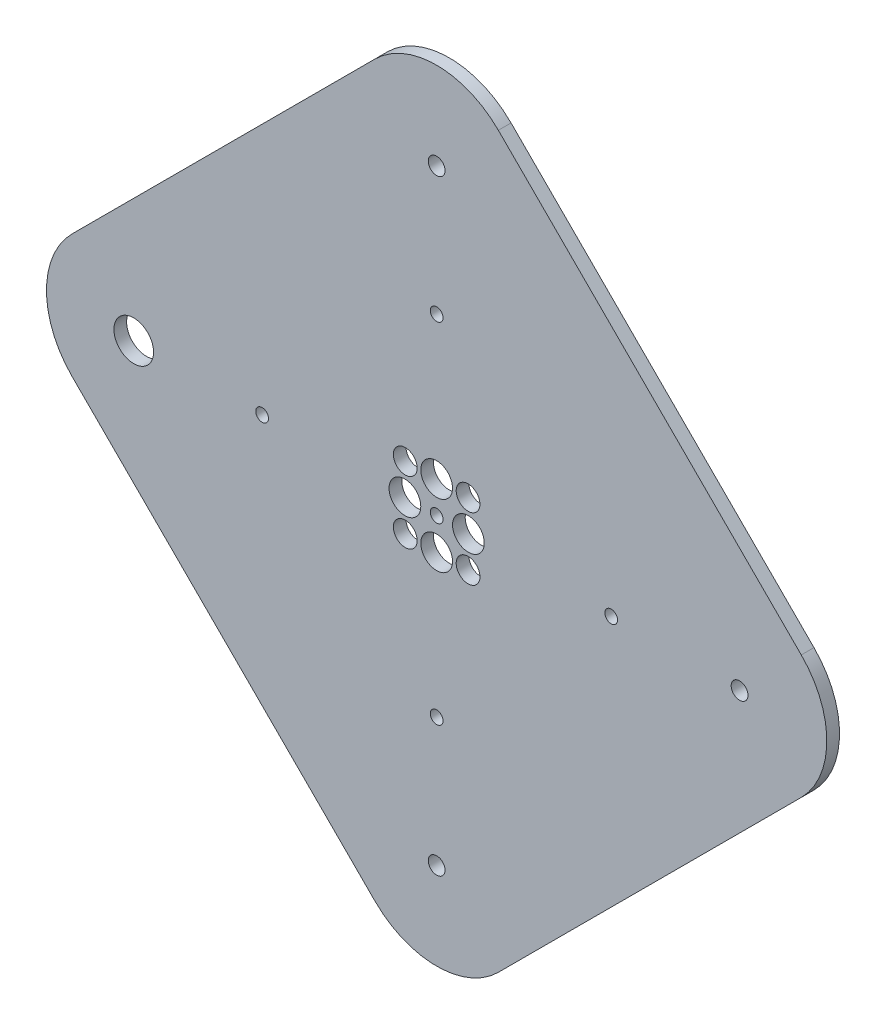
ISO-10303-21;
HEADER;
FILE_DESCRIPTION(('STEP AP214'),'2;1');
FILE_NAME('part.step','',(''),(''),'','','');
FILE_SCHEMA(('AUTOMOTIVE_DESIGN { 1 0 10303 214 1 1 1 1 }'));
ENDSEC;
DATA;
#1=APPLICATION_CONTEXT('core data for automotive mechanical design processes');
#2=APPLICATION_PROTOCOL_DEFINITION('international standard','automotive_design',2000,#1);
#3=PRODUCT_CONTEXT('',#1,'mechanical');
#4=PRODUCT('Part','Part','',(#3));
#5=PRODUCT_RELATED_PRODUCT_CATEGORY('part','',(#4));
#6=PRODUCT_DEFINITION_FORMATION('','',#4);
#7=PRODUCT_DEFINITION_CONTEXT('part definition',#1,'design');
#8=PRODUCT_DEFINITION('design','',#6,#7);
#9=PRODUCT_DEFINITION_SHAPE('','',#8);
#10=(LENGTH_UNIT() NAMED_UNIT(*) SI_UNIT(.MILLI.,.METRE.));
#11=(NAMED_UNIT(*) PLANE_ANGLE_UNIT() SI_UNIT($,.RADIAN.));
#12=(NAMED_UNIT(*) SI_UNIT($,.STERADIAN.) SOLID_ANGLE_UNIT());
#13=UNCERTAINTY_MEASURE_WITH_UNIT(LENGTH_MEASURE(1.E-05),#10,'distance_accuracy_value','');
#14=(GEOMETRIC_REPRESENTATION_CONTEXT(3) GLOBAL_UNCERTAINTY_ASSIGNED_CONTEXT((#13)) GLOBAL_UNIT_ASSIGNED_CONTEXT((#10,
#11,#12)) REPRESENTATION_CONTEXT('',''));
#15=CARTESIAN_POINT('',(0.,0.,0.));
#16=DIRECTION('',(0.,0.,1.));
#17=DIRECTION('',(1.,0.,0.));
#18=AXIS2_PLACEMENT_3D('',#15,#16,#17);
#19=CARTESIAN_POINT('',(-121.233457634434,-2.08166817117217E-13,5.08));
#20=DIRECTION('',(0.,0.,-1.));
#21=DIRECTION('',(-1.,0.,0.));
#22=AXIS2_PLACEMENT_3D('',#19,#20,#21);
#23=CYLINDRICAL_SURFACE('',#22,34.925);
#24=CARTESIAN_POINT('',(-121.233457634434,-2.08166817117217E-13,0.));
#25=DIRECTION('',(0.,0.,1.));
#26=DIRECTION('',(1.,0.,0.));
#27=AXIS2_PLACEMENT_3D('',#24,#25,#26);
#28=CIRCLE('',#27,34.925);
#29=CARTESIAN_POINT('',(-145.929161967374,24.6957043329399,0.));
#30=VERTEX_POINT('',#29);
#31=CARTESIAN_POINT('',(-145.929161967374,-24.6957043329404,0.));
#32=VERTEX_POINT('',#31);
#33=EDGE_CURVE('E136',#30,#32,#28,.T.);
#34=ORIENTED_EDGE('',*,*,#33,.T.);
#35=DIRECTION('',(0.,0.,-1.));
#36=VECTOR('',#35,1.);
#37=CARTESIAN_POINT('',(-145.929161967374,-24.6957043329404,5.08));
#38=LINE('',#37,#36);
#39=CARTESIAN_POINT('',(-145.929161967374,-24.6957043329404,5.08));
#40=VERTEX_POINT('',#39);
#41=EDGE_CURVE('E11',#40,#32,#38,.T.);
#42=ORIENTED_EDGE('',*,*,#41,.F.);
#43=CARTESIAN_POINT('',(-121.233457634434,-2.08166817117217E-13,5.08));
#44=DIRECTION('',(0.,0.,1.));
#45=DIRECTION('',(1.,0.,0.));
#46=AXIS2_PLACEMENT_3D('',#43,#44,#45);
#47=CIRCLE('',#46,34.925);
#48=CARTESIAN_POINT('',(-145.929161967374,24.6957043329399,5.08));
#49=VERTEX_POINT('',#48);
#50=EDGE_CURVE('E151',#49,#40,#47,.T.);
#51=ORIENTED_EDGE('',*,*,#50,.F.);
#52=DIRECTION('',(0.,0.,-1.));
#53=VECTOR('',#52,1.);
#54=CARTESIAN_POINT('',(-145.929161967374,24.6957043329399,5.08));
#55=LINE('',#54,#53);
#56=EDGE_CURVE('E132',#49,#30,#55,.T.);
#57=ORIENTED_EDGE('',*,*,#56,.T.);
#58=EDGE_LOOP('',(#34,#42,#51,#57));
#59=FACE_BOUND('',#58,.T.);
#60=ADVANCED_FACE('F40',(#59),#23,.T.);
#61=CARTESIAN_POINT('',(-145.929161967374,-24.6957043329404,5.08));
#62=DIRECTION('',(0.707106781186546,0.707106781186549,0.));
#63=DIRECTION('',(-0.707106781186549,0.707106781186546,0.));
#64=AXIS2_PLACEMENT_3D('',#61,#62,#63);
#65=PLANE('',#64);
#66=DIRECTION('',(0.707106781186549,-0.707106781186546,0.));
#67=VECTOR('',#66,1.);
#68=CARTESIAN_POINT('',(-145.929161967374,-24.6957043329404,0.));
#69=LINE('',#68,#67);
#70=CARTESIAN_POINT('',(-24.6957043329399,-145.929161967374,0.));
#71=VERTEX_POINT('',#70);
#72=EDGE_CURVE('E139',#32,#71,#69,.T.);
#73=ORIENTED_EDGE('',*,*,#72,.T.);
#74=DIRECTION('',(0.,0.,-1.));
#75=VECTOR('',#74,1.);
#76=CARTESIAN_POINT('',(-24.6957043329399,-145.929161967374,5.08));
#77=LINE('',#76,#75);
#78=CARTESIAN_POINT('',(-24.6957043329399,-145.929161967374,5.08));
#79=VERTEX_POINT('',#78);
#80=EDGE_CURVE('E48',#79,#71,#77,.T.);
#81=ORIENTED_EDGE('',*,*,#80,.F.);
#82=DIRECTION('',(0.707106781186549,-0.707106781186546,0.));
#83=VECTOR('',#82,1.);
#84=CARTESIAN_POINT('',(-145.929161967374,-24.6957043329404,5.08));
#85=LINE('',#84,#83);
#86=EDGE_CURVE('E99',#40,#79,#85,.T.);
#87=ORIENTED_EDGE('',*,*,#86,.F.);
#88=ORIENTED_EDGE('',*,*,#41,.T.);
#89=EDGE_LOOP('',(#73,#81,#87,#88));
#90=FACE_BOUND('',#89,.T.);
#91=ADVANCED_FACE('F340',(#90),#65,.F.);
#92=CARTESIAN_POINT('',(2.08166817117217E-13,-121.233457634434,5.08));
#93=DIRECTION('',(0.,0.,-1.));
#94=DIRECTION('',(-1.,0.,0.));
#95=AXIS2_PLACEMENT_3D('',#92,#93,#94);
#96=CYLINDRICAL_SURFACE('',#95,34.925);
#97=CARTESIAN_POINT('',(2.08166817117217E-13,-121.233457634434,0.));
#98=DIRECTION('',(0.,0.,1.));
#99=DIRECTION('',(1.,0.,0.));
#100=AXIS2_PLACEMENT_3D('',#97,#98,#99);
#101=CIRCLE('',#100,34.925);
#102=CARTESIAN_POINT('',(24.6957043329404,-145.929161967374,0.));
#103=VERTEX_POINT('',#102);
#104=EDGE_CURVE('E142',#71,#103,#101,.T.);
#105=ORIENTED_EDGE('',*,*,#104,.T.);
#106=DIRECTION('',(0.,0.,-1.));
#107=VECTOR('',#106,1.);
#108=CARTESIAN_POINT('',(24.6957043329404,-145.929161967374,5.08));
#109=LINE('',#108,#107);
#110=CARTESIAN_POINT('',(24.6957043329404,-145.929161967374,5.08));
#111=VERTEX_POINT('',#110);
#112=EDGE_CURVE('E158',#111,#103,#109,.T.);
#113=ORIENTED_EDGE('',*,*,#112,.F.);
#114=CARTESIAN_POINT('',(2.08166817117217E-13,-121.233457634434,5.08));
#115=DIRECTION('',(0.,0.,1.));
#116=DIRECTION('',(1.,0.,0.));
#117=AXIS2_PLACEMENT_3D('',#114,#115,#116);
#118=CIRCLE('',#117,34.925);
#119=EDGE_CURVE('E166',#79,#111,#118,.T.);
#120=ORIENTED_EDGE('',*,*,#119,.F.);
#121=ORIENTED_EDGE('',*,*,#80,.T.);
#122=EDGE_LOOP('',(#105,#113,#120,#121));
#123=FACE_BOUND('',#122,.T.);
#124=ADVANCED_FACE('F164',(#123),#96,.T.);
#125=CARTESIAN_POINT('',(24.6957043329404,-145.929161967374,5.08));
#126=DIRECTION('',(-0.707106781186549,0.707106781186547,0.));
#127=DIRECTION('',(-0.707106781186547,-0.707106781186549,0.));
#128=AXIS2_PLACEMENT_3D('',#125,#126,#127);
#129=PLANE('',#128);
#130=DIRECTION('',(0.707106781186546,0.707106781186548,0.));
#131=VECTOR('',#130,1.);
#132=CARTESIAN_POINT('',(24.6957043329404,-145.929161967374,0.));
#133=LINE('',#132,#131);
#134=CARTESIAN_POINT('',(145.929161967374,-24.6957043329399,0.));
#135=VERTEX_POINT('',#134);
#136=EDGE_CURVE('E144',#103,#135,#133,.T.);
#137=ORIENTED_EDGE('',*,*,#136,.T.);
#138=DIRECTION('',(0.,0.,-1.));
#139=VECTOR('',#138,1.);
#140=CARTESIAN_POINT('',(145.929161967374,-24.6957043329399,5.08));
#141=LINE('',#140,#139);
#142=CARTESIAN_POINT('',(145.929161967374,-24.6957043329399,5.08));
#143=VERTEX_POINT('',#142);
#144=EDGE_CURVE('E155',#143,#135,#141,.T.);
#145=ORIENTED_EDGE('',*,*,#144,.F.);
#146=DIRECTION('',(0.707106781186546,0.707106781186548,0.));
#147=VECTOR('',#146,1.);
#148=CARTESIAN_POINT('',(24.6957043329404,-145.929161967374,5.08));
#149=LINE('',#148,#147);
#150=EDGE_CURVE('E178',#111,#143,#149,.T.);
#151=ORIENTED_EDGE('',*,*,#150,.F.);
#152=ORIENTED_EDGE('',*,*,#112,.T.);
#153=EDGE_LOOP('',(#137,#145,#151,#152));
#154=FACE_BOUND('',#153,.T.);
#155=ADVANCED_FACE('F174',(#154),#129,.F.);
#156=CARTESIAN_POINT('',(121.233457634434,1.94289029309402E-13,5.08));
#157=DIRECTION('',(0.,0.,-1.));
#158=DIRECTION('',(-1.,0.,0.));
#159=AXIS2_PLACEMENT_3D('',#156,#157,#158);
#160=CYLINDRICAL_SURFACE('',#159,34.925);
#161=CARTESIAN_POINT('',(121.233457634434,1.94289029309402E-13,0.));
#162=DIRECTION('',(0.,0.,1.));
#163=DIRECTION('',(1.,0.,0.));
#164=AXIS2_PLACEMENT_3D('',#161,#162,#163);
#165=CIRCLE('',#164,34.925);
#166=CARTESIAN_POINT('',(145.929161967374,24.6957043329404,0.));
#167=VERTEX_POINT('',#166);
#168=EDGE_CURVE('E146',#135,#167,#165,.T.);
#169=ORIENTED_EDGE('',*,*,#168,.T.);
#170=DIRECTION('',(0.,0.,-1.));
#171=VECTOR('',#170,1.);
#172=CARTESIAN_POINT('',(145.929161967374,24.6957043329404,5.08));
#173=LINE('',#172,#171);
#174=CARTESIAN_POINT('',(145.929161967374,24.6957043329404,5.08));
#175=VERTEX_POINT('',#174);
#176=EDGE_CURVE('E127',#175,#167,#173,.T.);
#177=ORIENTED_EDGE('',*,*,#176,.F.);
#178=CARTESIAN_POINT('',(121.233457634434,1.94289029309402E-13,5.08));
#179=DIRECTION('',(0.,0.,1.));
#180=DIRECTION('',(1.,0.,0.));
#181=AXIS2_PLACEMENT_3D('',#178,#179,#180);
#182=CIRCLE('',#181,34.925);
#183=EDGE_CURVE('E118',#143,#175,#182,.T.);
#184=ORIENTED_EDGE('',*,*,#183,.F.);
#185=ORIENTED_EDGE('',*,*,#144,.T.);
#186=EDGE_LOOP('',(#169,#177,#184,#185));
#187=FACE_BOUND('',#186,.T.);
#188=ADVANCED_FACE('F177',(#187),#160,.T.);
#189=CARTESIAN_POINT('',(145.929161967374,24.6957043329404,5.08));
#190=DIRECTION('',(-0.707106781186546,-0.707106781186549,0.));
#191=DIRECTION('',(0.707106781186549,-0.707106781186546,0.));
#192=AXIS2_PLACEMENT_3D('',#189,#190,#191);
#193=PLANE('',#192);
#194=DIRECTION('',(-0.707106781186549,0.707106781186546,0.));
#195=VECTOR('',#194,1.);
#196=CARTESIAN_POINT('',(145.929161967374,24.6957043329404,0.));
#197=LINE('',#196,#195);
#198=CARTESIAN_POINT('',(24.6957043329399,145.929161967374,0.));
#199=VERTEX_POINT('',#198);
#200=EDGE_CURVE('E126',#167,#199,#197,.T.);
#201=ORIENTED_EDGE('',*,*,#200,.T.);
#202=DIRECTION('',(0.,0.,-1.));
#203=VECTOR('',#202,1.);
#204=CARTESIAN_POINT('',(24.6957043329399,145.929161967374,5.08));
#205=LINE('',#204,#203);
#206=CARTESIAN_POINT('',(24.6957043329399,145.929161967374,5.08));
#207=VERTEX_POINT('',#206);
#208=EDGE_CURVE('E123',#207,#199,#205,.T.);
#209=ORIENTED_EDGE('',*,*,#208,.F.);
#210=DIRECTION('',(-0.707106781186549,0.707106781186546,0.));
#211=VECTOR('',#210,1.);
#212=CARTESIAN_POINT('',(145.929161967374,24.6957043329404,5.08));
#213=LINE('',#212,#211);
#214=EDGE_CURVE('E112',#175,#207,#213,.T.);
#215=ORIENTED_EDGE('',*,*,#214,.F.);
#216=ORIENTED_EDGE('',*,*,#176,.T.);
#217=EDGE_LOOP('',(#201,#209,#215,#216));
#218=FACE_BOUND('',#217,.T.);
#219=ADVANCED_FACE('F124',(#218),#193,.F.);
#220=CARTESIAN_POINT('',(-2.42861286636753E-13,121.233457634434,5.08));
#221=DIRECTION('',(0.,0.,-1.));
#222=DIRECTION('',(-1.,0.,0.));
#223=AXIS2_PLACEMENT_3D('',#220,#221,#222);
#224=CYLINDRICAL_SURFACE('',#223,34.925);
#225=CARTESIAN_POINT('',(-2.42861286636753E-13,121.233457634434,0.));
#226=DIRECTION('',(0.,0.,1.));
#227=DIRECTION('',(1.,0.,0.));
#228=AXIS2_PLACEMENT_3D('',#225,#226,#227);
#229=CIRCLE('',#228,34.925);
#230=CARTESIAN_POINT('',(-24.6957043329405,145.929161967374,0.));
#231=VERTEX_POINT('',#230);
#232=EDGE_CURVE('E85',#199,#231,#229,.T.);
#233=ORIENTED_EDGE('',*,*,#232,.T.);
#234=DIRECTION('',(0.,0.,-1.));
#235=VECTOR('',#234,1.);
#236=CARTESIAN_POINT('',(-24.6957043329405,145.929161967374,5.08));
#237=LINE('',#236,#235);
#238=CARTESIAN_POINT('',(-24.6957043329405,145.929161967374,5.08));
#239=VERTEX_POINT('',#238);
#240=EDGE_CURVE('E128',#239,#231,#237,.T.);
#241=ORIENTED_EDGE('',*,*,#240,.F.);
#242=CARTESIAN_POINT('',(-2.42861286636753E-13,121.233457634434,5.08));
#243=DIRECTION('',(0.,0.,1.));
#244=DIRECTION('',(1.,0.,0.));
#245=AXIS2_PLACEMENT_3D('',#242,#243,#244);
#246=CIRCLE('',#245,34.925);
#247=EDGE_CURVE('E116',#207,#239,#246,.T.);
#248=ORIENTED_EDGE('',*,*,#247,.F.);
#249=ORIENTED_EDGE('',*,*,#208,.T.);
#250=EDGE_LOOP('',(#233,#241,#248,#249));
#251=FACE_BOUND('',#250,.T.);
#252=ADVANCED_FACE('F130',(#251),#224,.T.);
#253=CARTESIAN_POINT('',(-24.6957043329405,145.929161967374,5.08));
#254=DIRECTION('',(0.707106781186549,-0.707106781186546,0.));
#255=DIRECTION('',(0.707106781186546,0.707106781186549,0.));
#256=AXIS2_PLACEMENT_3D('',#253,#254,#255);
#257=PLANE('',#256);
#258=DIRECTION('',(-0.707106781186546,-0.707106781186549,0.));
#259=VECTOR('',#258,1.);
#260=CARTESIAN_POINT('',(-24.6957043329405,145.929161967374,0.));
#261=LINE('',#260,#259);
#262=EDGE_CURVE('E91',#231,#30,#261,.T.);
#263=ORIENTED_EDGE('',*,*,#262,.T.);
#264=ORIENTED_EDGE('',*,*,#56,.F.);
#265=DIRECTION('',(-0.707106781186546,-0.707106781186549,0.));
#266=VECTOR('',#265,1.);
#267=CARTESIAN_POINT('',(-24.6957043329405,145.929161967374,5.08));
#268=LINE('',#267,#266);
#269=EDGE_CURVE('E56',#239,#49,#268,.T.);
#270=ORIENTED_EDGE('',*,*,#269,.F.);
#271=ORIENTED_EDGE('',*,*,#240,.T.);
#272=EDGE_LOOP('',(#263,#264,#270,#271));
#273=FACE_BOUND('',#272,.T.);
#274=ADVANCED_FACE('F290',(#273),#257,.F.);
#275=CARTESIAN_POINT('',(-121.233457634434,-2.08166817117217E-13,5.08));
#276=DIRECTION('',(0.,0.,1.));
#277=DIRECTION('',(1.,0.,0.));
#278=AXIS2_PLACEMENT_3D('',#275,#276,#277);
#279=PLANE('',#278);
#280=CARTESIAN_POINT('',(0.,69.85,5.08));
#281=DIRECTION('',(0.,0.,1.));
#282=DIRECTION('',(1.,0.,0.));
#283=AXIS2_PLACEMENT_3D('',#280,#281,#282);
#284=CIRCLE('',#283,2.55269999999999);
#285=CARTESIAN_POINT('',(2.55269999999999,69.85,5.08));
#286=VERTEX_POINT('',#285);
#287=EDGE_CURVE('E282',#286,#286,#284,.T.);
#288=ORIENTED_EDGE('',*,*,#287,.F.);
#289=EDGE_LOOP('',(#288));
#290=FACE_BOUND('',#289,.T.);
#291=CARTESIAN_POINT('',(69.85,-2.43879971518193E-13,5.08));
#292=DIRECTION('',(0.,0.,1.));
#293=DIRECTION('',(1.,0.,0.));
#294=AXIS2_PLACEMENT_3D('',#291,#292,#293);
#295=CIRCLE('',#294,2.55269999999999);
#296=CARTESIAN_POINT('',(72.4027,-2.43879971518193E-13,5.08));
#297=VERTEX_POINT('',#296);
#298=EDGE_CURVE('E276',#297,#297,#295,.T.);
#299=ORIENTED_EDGE('',*,*,#298,.F.);
#300=EDGE_LOOP('',(#299));
#301=FACE_BOUND('',#300,.T.);
#302=CARTESIAN_POINT('',(-4.87759943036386E-13,-69.85,5.08));
#303=DIRECTION('',(0.,0.,1.));
#304=DIRECTION('',(1.,0.,0.));
#305=AXIS2_PLACEMENT_3D('',#302,#303,#304);
#306=CIRCLE('',#305,2.55269999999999);
#307=CARTESIAN_POINT('',(2.5526999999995,-69.85,5.08));
#308=VERTEX_POINT('',#307);
#309=EDGE_CURVE('E270',#308,#308,#306,.T.);
#310=ORIENTED_EDGE('',*,*,#309,.F.);
#311=EDGE_LOOP('',(#310));
#312=FACE_BOUND('',#311,.T.);
#313=CARTESIAN_POINT('',(-69.85,7.31639914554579E-13,5.08));
#314=DIRECTION('',(0.,0.,1.));
#315=DIRECTION('',(1.,0.,0.));
#316=AXIS2_PLACEMENT_3D('',#313,#314,#315);
#317=CIRCLE('',#316,2.55269999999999);
#318=CARTESIAN_POINT('',(-67.2973,7.31639914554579E-13,5.08));
#319=VERTEX_POINT('',#318);
#320=EDGE_CURVE('E264',#319,#319,#317,.T.);
#321=ORIENTED_EDGE('',*,*,#320,.F.);
#322=EDGE_LOOP('',(#321));
#323=FACE_BOUND('',#322,.T.);
#324=CARTESIAN_POINT('',(-2.42861286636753E-13,121.233457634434,5.08));
#325=DIRECTION('',(0.,0.,1.));
#326=DIRECTION('',(1.,0.,0.));
#327=AXIS2_PLACEMENT_3D('',#324,#325,#326);
#328=CIRCLE('',#327,3.3655);
#329=CARTESIAN_POINT('',(3.36549999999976,121.233457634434,5.08));
#330=VERTEX_POINT('',#329);
#331=EDGE_CURVE('E257',#330,#330,#328,.T.);
#332=ORIENTED_EDGE('',*,*,#331,.F.);
#333=EDGE_LOOP('',(#332));
#334=FACE_BOUND('',#333,.T.);
#335=CARTESIAN_POINT('',(121.233457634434,1.94289029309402E-13,5.08));
#336=DIRECTION('',(0.,0.,1.));
#337=DIRECTION('',(1.,0.,0.));
#338=AXIS2_PLACEMENT_3D('',#335,#336,#337);
#339=CIRCLE('',#338,3.3655);
#340=CARTESIAN_POINT('',(124.598957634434,1.94289029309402E-13,5.08));
#341=VERTEX_POINT('',#340);
#342=EDGE_CURVE('E251',#341,#341,#339,.T.);
#343=ORIENTED_EDGE('',*,*,#342,.F.);
#344=EDGE_LOOP('',(#343));
#345=FACE_BOUND('',#344,.T.);
#346=CARTESIAN_POINT('',(2.0122792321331E-13,-121.233457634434,5.08));
#347=DIRECTION('',(0.,0.,1.));
#348=DIRECTION('',(1.,0.,0.));
#349=AXIS2_PLACEMENT_3D('',#346,#347,#348);
#350=CIRCLE('',#349,3.3655);
#351=CARTESIAN_POINT('',(3.3655000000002,-121.233457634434,5.08));
#352=VERTEX_POINT('',#351);
#353=EDGE_CURVE('E244',#352,#352,#350,.T.);
#354=ORIENTED_EDGE('',*,*,#353,.F.);
#355=EDGE_LOOP('',(#354));
#356=FACE_BOUND('',#355,.T.);
#357=CARTESIAN_POINT('',(-121.233457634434,-1.94289029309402E-13,5.08));
#358=DIRECTION('',(0.,0.,1.));
#359=DIRECTION('',(1.,0.,0.));
#360=AXIS2_PLACEMENT_3D('',#357,#358,#359);
#361=CIRCLE('',#360,7.93749999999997);
#362=CARTESIAN_POINT('',(-113.295957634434,-1.94289029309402E-13,5.08));
#363=VERTEX_POINT('',#362);
#364=EDGE_CURVE('E238',#363,#363,#361,.T.);
#365=ORIENTED_EDGE('',*,*,#364,.F.);
#366=EDGE_LOOP('',(#365));
#367=FACE_BOUND('',#366,.T.);
#368=CARTESIAN_POINT('',(12.5723585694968,12.5723585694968,5.08));
#369=DIRECTION('',(0.,0.,1.));
#370=DIRECTION('',(1.,0.,0.));
#371=AXIS2_PLACEMENT_3D('',#368,#369,#370);
#372=CIRCLE('',#371,4.76250000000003);
#373=CARTESIAN_POINT('',(17.3348585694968,12.5723585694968,5.08));
#374=VERTEX_POINT('',#373);
#375=EDGE_CURVE('E233',#374,#374,#372,.T.);
#376=ORIENTED_EDGE('',*,*,#375,.F.);
#377=EDGE_LOOP('',(#376));
#378=FACE_BOUND('',#377,.T.);
#379=CARTESIAN_POINT('',(12.5723585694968,-12.5723585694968,5.08));
#380=DIRECTION('',(0.,0.,1.));
#381=DIRECTION('',(1.,0.,0.));
#382=AXIS2_PLACEMENT_3D('',#379,#380,#381);
#383=CIRCLE('',#382,4.7625);
#384=CARTESIAN_POINT('',(17.3348585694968,-12.5723585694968,5.08));
#385=VERTEX_POINT('',#384);
#386=EDGE_CURVE('E227',#385,#385,#383,.T.);
#387=ORIENTED_EDGE('',*,*,#386,.F.);
#388=EDGE_LOOP('',(#387));
#389=FACE_BOUND('',#388,.T.);
#390=CARTESIAN_POINT('',(-12.5723585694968,-12.5723585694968,5.08));
#391=DIRECTION('',(0.,0.,1.));
#392=DIRECTION('',(1.,0.,0.));
#393=AXIS2_PLACEMENT_3D('',#390,#391,#392);
#394=CIRCLE('',#393,4.7625);
#395=CARTESIAN_POINT('',(-7.80985856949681,-12.5723585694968,5.08));
#396=VERTEX_POINT('',#395);
#397=EDGE_CURVE('E220',#396,#396,#394,.T.);
#398=ORIENTED_EDGE('',*,*,#397,.F.);
#399=EDGE_LOOP('',(#398));
#400=FACE_BOUND('',#399,.T.);
#401=CARTESIAN_POINT('',(-12.5723585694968,12.5723585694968,5.08));
#402=DIRECTION('',(0.,0.,1.));
#403=DIRECTION('',(1.,0.,0.));
#404=AXIS2_PLACEMENT_3D('',#401,#402,#403);
#405=CIRCLE('',#404,4.7625);
#406=CARTESIAN_POINT('',(-7.80985856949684,12.5723585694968,5.08));
#407=VERTEX_POINT('',#406);
#408=EDGE_CURVE('E214',#407,#407,#405,.T.);
#409=ORIENTED_EDGE('',*,*,#408,.F.);
#410=EDGE_LOOP('',(#409));
#411=FACE_BOUND('',#410,.T.);
#412=CARTESIAN_POINT('',(0.,0.,5.08));
#413=DIRECTION('',(0.,0.,1.));
#414=DIRECTION('',(1.,0.,0.));
#415=AXIS2_PLACEMENT_3D('',#412,#413,#414);
#416=CIRCLE('',#415,2.5527);
#417=CARTESIAN_POINT('',(2.5527,0.,5.08));
#418=VERTEX_POINT('',#417);
#419=EDGE_CURVE('E210',#418,#418,#416,.T.);
#420=ORIENTED_EDGE('',*,*,#419,.F.);
#421=EDGE_LOOP('',(#420));
#422=FACE_BOUND('',#421,.T.);
#423=CARTESIAN_POINT('',(0.,-12.7,5.08));
#424=DIRECTION('',(0.,0.,1.));
#425=DIRECTION('',(1.,0.,0.));
#426=AXIS2_PLACEMENT_3D('',#423,#424,#425);
#427=CIRCLE('',#426,6.35000000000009);
#428=CARTESIAN_POINT('',(6.35000000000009,-12.7,5.08));
#429=VERTEX_POINT('',#428);
#430=EDGE_CURVE('E196',#429,#429,#427,.T.);
#431=ORIENTED_EDGE('',*,*,#430,.F.);
#432=EDGE_LOOP('',(#431));
#433=FACE_BOUND('',#432,.T.);
#434=CARTESIAN_POINT('',(-12.7,0.,5.08));
#435=DIRECTION('',(0.,0.,1.));
#436=DIRECTION('',(1.,0.,0.));
#437=AXIS2_PLACEMENT_3D('',#434,#435,#436);
#438=CIRCLE('',#437,6.35000000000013);
#439=CARTESIAN_POINT('',(-6.34999999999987,0.,5.08));
#440=VERTEX_POINT('',#439);
#441=EDGE_CURVE('E202',#440,#440,#438,.T.);
#442=ORIENTED_EDGE('',*,*,#441,.F.);
#443=EDGE_LOOP('',(#442));
#444=FACE_BOUND('',#443,.T.);
#445=CARTESIAN_POINT('',(12.7,0.,5.08));
#446=DIRECTION('',(0.,0.,1.));
#447=DIRECTION('',(1.,0.,0.));
#448=AXIS2_PLACEMENT_3D('',#445,#446,#447);
#449=CIRCLE('',#448,6.35000000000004);
#450=CARTESIAN_POINT('',(19.05,0.,5.08));
#451=VERTEX_POINT('',#450);
#452=EDGE_CURVE('E190',#451,#451,#449,.T.);
#453=ORIENTED_EDGE('',*,*,#452,.F.);
#454=EDGE_LOOP('',(#453));
#455=FACE_BOUND('',#454,.T.);
#456=CARTESIAN_POINT('',(0.,12.7,5.08));
#457=DIRECTION('',(0.,0.,1.));
#458=DIRECTION('',(1.,0.,0.));
#459=AXIS2_PLACEMENT_3D('',#456,#457,#458);
#460=CIRCLE('',#459,6.35);
#461=CARTESIAN_POINT('',(6.35,12.7,5.08));
#462=VERTEX_POINT('',#461);
#463=EDGE_CURVE('E184',#462,#462,#460,.T.);
#464=ORIENTED_EDGE('',*,*,#463,.F.);
#465=EDGE_LOOP('',(#464));
#466=FACE_BOUND('',#465,.T.);
#467=ORIENTED_EDGE('',*,*,#50,.T.);
#468=ORIENTED_EDGE('',*,*,#86,.T.);
#469=ORIENTED_EDGE('',*,*,#119,.T.);
#470=ORIENTED_EDGE('',*,*,#150,.T.);
#471=ORIENTED_EDGE('',*,*,#183,.T.);
#472=ORIENTED_EDGE('',*,*,#214,.T.);
#473=ORIENTED_EDGE('',*,*,#247,.T.);
#474=ORIENTED_EDGE('',*,*,#269,.T.);
#475=EDGE_LOOP('',(#467,#468,#469,#470,#471,#472,#473,#474));
#476=FACE_BOUND('',#475,.T.);
#477=ADVANCED_FACE('F114',(#290,#301,#312,#323,#334,#345,#356,#367,#378,#389,#400,#411,#422,
#433,#444,#455,#466,#476),#279,.T.);
#478=CARTESIAN_POINT('',(-121.233457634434,-2.08166817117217E-13,0.));
#479=DIRECTION('',(0.,0.,1.));
#480=DIRECTION('',(1.,0.,0.));
#481=AXIS2_PLACEMENT_3D('',#478,#479,#480);
#482=PLANE('',#481);
#483=CARTESIAN_POINT('',(0.,69.85,0.));
#484=DIRECTION('',(0.,0.,1.));
#485=DIRECTION('',(1.,0.,0.));
#486=AXIS2_PLACEMENT_3D('',#483,#484,#485);
#487=CIRCLE('',#486,2.5527);
#488=CARTESIAN_POINT('',(2.5527,69.85,0.));
#489=VERTEX_POINT('',#488);
#490=EDGE_CURVE('E279',#489,#489,#487,.T.);
#491=ORIENTED_EDGE('',*,*,#490,.T.);
#492=EDGE_LOOP('',(#491));
#493=FACE_BOUND('',#492,.T.);
#494=CARTESIAN_POINT('',(69.85,-2.43879971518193E-13,0.));
#495=DIRECTION('',(0.,0.,1.));
#496=DIRECTION('',(1.,0.,0.));
#497=AXIS2_PLACEMENT_3D('',#494,#495,#496);
#498=CIRCLE('',#497,2.55270000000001);
#499=CARTESIAN_POINT('',(72.4027,-2.43879971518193E-13,0.));
#500=VERTEX_POINT('',#499);
#501=EDGE_CURVE('E273',#500,#500,#498,.T.);
#502=ORIENTED_EDGE('',*,*,#501,.T.);
#503=EDGE_LOOP('',(#502));
#504=FACE_BOUND('',#503,.T.);
#505=CARTESIAN_POINT('',(-4.87759943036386E-13,-69.85,0.));
#506=DIRECTION('',(0.,0.,1.));
#507=DIRECTION('',(1.,0.,0.));
#508=AXIS2_PLACEMENT_3D('',#505,#506,#507);
#509=CIRCLE('',#508,2.5527);
#510=CARTESIAN_POINT('',(2.55269999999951,-69.85,0.));
#511=VERTEX_POINT('',#510);
#512=EDGE_CURVE('E267',#511,#511,#509,.T.);
#513=ORIENTED_EDGE('',*,*,#512,.T.);
#514=EDGE_LOOP('',(#513));
#515=FACE_BOUND('',#514,.T.);
#516=CARTESIAN_POINT('',(-69.85,7.31639914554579E-13,0.));
#517=DIRECTION('',(0.,0.,1.));
#518=DIRECTION('',(1.,0.,0.));
#519=AXIS2_PLACEMENT_3D('',#516,#517,#518);
#520=CIRCLE('',#519,2.55270000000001);
#521=CARTESIAN_POINT('',(-67.2973,7.31639914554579E-13,0.));
#522=VERTEX_POINT('',#521);
#523=EDGE_CURVE('E248',#522,#522,#520,.T.);
#524=ORIENTED_EDGE('',*,*,#523,.T.);
#525=EDGE_LOOP('',(#524));
#526=FACE_BOUND('',#525,.T.);
#527=CARTESIAN_POINT('',(-2.42861286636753E-13,121.233457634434,0.));
#528=DIRECTION('',(0.,0.,1.));
#529=DIRECTION('',(1.,0.,0.));
#530=AXIS2_PLACEMENT_3D('',#527,#528,#529);
#531=CIRCLE('',#530,3.3655);
#532=CARTESIAN_POINT('',(3.36549999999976,121.233457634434,0.));
#533=VERTEX_POINT('',#532);
#534=EDGE_CURVE('E241',#533,#533,#531,.T.);
#535=ORIENTED_EDGE('',*,*,#534,.T.);
#536=EDGE_LOOP('',(#535));
#537=FACE_BOUND('',#536,.T.);
#538=CARTESIAN_POINT('',(121.233457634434,1.94289029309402E-13,0.));
#539=DIRECTION('',(0.,0.,1.));
#540=DIRECTION('',(1.,0.,0.));
#541=AXIS2_PLACEMENT_3D('',#538,#539,#540);
#542=CIRCLE('',#541,3.3655);
#543=CARTESIAN_POINT('',(124.598957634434,1.94289029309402E-13,0.));
#544=VERTEX_POINT('',#543);
#545=EDGE_CURVE('E254',#544,#544,#542,.T.);
#546=ORIENTED_EDGE('',*,*,#545,.T.);
#547=EDGE_LOOP('',(#546));
#548=FACE_BOUND('',#547,.T.);
#549=CARTESIAN_POINT('',(2.0122792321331E-13,-121.233457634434,0.));
#550=DIRECTION('',(0.,0.,1.));
#551=DIRECTION('',(1.,0.,0.));
#552=AXIS2_PLACEMENT_3D('',#549,#550,#551);
#553=CIRCLE('',#552,3.3655);
#554=CARTESIAN_POINT('',(3.3655000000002,-121.233457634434,0.));
#555=VERTEX_POINT('',#554);
#556=EDGE_CURVE('E247',#555,#555,#553,.T.);
#557=ORIENTED_EDGE('',*,*,#556,.T.);
#558=EDGE_LOOP('',(#557));
#559=FACE_BOUND('',#558,.T.);
#560=CARTESIAN_POINT('',(-121.233457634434,-1.94289029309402E-13,0.));
#561=DIRECTION('',(0.,0.,1.));
#562=DIRECTION('',(1.,0.,0.));
#563=AXIS2_PLACEMENT_3D('',#560,#561,#562);
#564=CIRCLE('',#563,7.93749999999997);
#565=CARTESIAN_POINT('',(-113.295957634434,-1.94289029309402E-13,0.));
#566=VERTEX_POINT('',#565);
#567=EDGE_CURVE('E224',#566,#566,#564,.T.);
#568=ORIENTED_EDGE('',*,*,#567,.T.);
#569=EDGE_LOOP('',(#568));
#570=FACE_BOUND('',#569,.T.);
#571=CARTESIAN_POINT('',(12.5723585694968,12.5723585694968,0.));
#572=DIRECTION('',(0.,0.,1.));
#573=DIRECTION('',(1.,0.,0.));
#574=AXIS2_PLACEMENT_3D('',#571,#572,#573);
#575=CIRCLE('',#574,4.76250000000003);
#576=CARTESIAN_POINT('',(17.3348585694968,12.5723585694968,0.));
#577=VERTEX_POINT('',#576);
#578=EDGE_CURVE('E217',#577,#577,#575,.T.);
#579=ORIENTED_EDGE('',*,*,#578,.T.);
#580=EDGE_LOOP('',(#579));
#581=FACE_BOUND('',#580,.T.);
#582=CARTESIAN_POINT('',(12.5723585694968,-12.5723585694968,0.));
#583=DIRECTION('',(0.,0.,1.));
#584=DIRECTION('',(1.,0.,0.));
#585=AXIS2_PLACEMENT_3D('',#582,#583,#584);
#586=CIRCLE('',#585,4.7625);
#587=CARTESIAN_POINT('',(17.3348585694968,-12.5723585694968,0.));
#588=VERTEX_POINT('',#587);
#589=EDGE_CURVE('E230',#588,#588,#586,.T.);
#590=ORIENTED_EDGE('',*,*,#589,.T.);
#591=EDGE_LOOP('',(#590));
#592=FACE_BOUND('',#591,.T.);
#593=CARTESIAN_POINT('',(-12.5723585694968,-12.5723585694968,0.));
#594=DIRECTION('',(0.,0.,1.));
#595=DIRECTION('',(1.,0.,0.));
#596=AXIS2_PLACEMENT_3D('',#593,#594,#595);
#597=CIRCLE('',#596,4.7625);
#598=CARTESIAN_POINT('',(-7.80985856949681,-12.5723585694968,0.));
#599=VERTEX_POINT('',#598);
#600=EDGE_CURVE('E223',#599,#599,#597,.T.);
#601=ORIENTED_EDGE('',*,*,#600,.T.);
#602=EDGE_LOOP('',(#601));
#603=FACE_BOUND('',#602,.T.);
#604=CARTESIAN_POINT('',(-12.5723585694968,12.5723585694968,0.));
#605=DIRECTION('',(0.,0.,1.));
#606=DIRECTION('',(1.,0.,0.));
#607=AXIS2_PLACEMENT_3D('',#604,#605,#606);
#608=CIRCLE('',#607,4.7625);
#609=CARTESIAN_POINT('',(-7.80985856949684,12.5723585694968,0.));
#610=VERTEX_POINT('',#609);
#611=EDGE_CURVE('E213',#610,#610,#608,.T.);
#612=ORIENTED_EDGE('',*,*,#611,.T.);
#613=EDGE_LOOP('',(#612));
#614=FACE_BOUND('',#613,.T.);
#615=CARTESIAN_POINT('',(0.,0.,0.));
#616=DIRECTION('',(0.,0.,1.));
#617=DIRECTION('',(1.,0.,0.));
#618=AXIS2_PLACEMENT_3D('',#615,#616,#617);
#619=CIRCLE('',#618,2.5527);
#620=CARTESIAN_POINT('',(2.5527,0.,0.));
#621=VERTEX_POINT('',#620);
#622=EDGE_CURVE('E205',#621,#621,#619,.T.);
#623=ORIENTED_EDGE('',*,*,#622,.T.);
#624=EDGE_LOOP('',(#623));
#625=FACE_BOUND('',#624,.T.);
#626=CARTESIAN_POINT('',(0.,-12.7,0.));
#627=DIRECTION('',(0.,0.,1.));
#628=DIRECTION('',(1.,0.,0.));
#629=AXIS2_PLACEMENT_3D('',#626,#627,#628);
#630=CIRCLE('',#629,6.35000000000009);
#631=CARTESIAN_POINT('',(6.35000000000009,-12.7,0.));
#632=VERTEX_POINT('',#631);
#633=EDGE_CURVE('E193',#632,#632,#630,.T.);
#634=ORIENTED_EDGE('',*,*,#633,.T.);
#635=EDGE_LOOP('',(#634));
#636=FACE_BOUND('',#635,.T.);
#637=CARTESIAN_POINT('',(-12.7,0.,0.));
#638=DIRECTION('',(0.,0.,1.));
#639=DIRECTION('',(1.,0.,0.));
#640=AXIS2_PLACEMENT_3D('',#637,#638,#639);
#641=CIRCLE('',#640,6.35000000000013);
#642=CARTESIAN_POINT('',(-6.34999999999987,0.,0.));
#643=VERTEX_POINT('',#642);
#644=EDGE_CURVE('E199',#643,#643,#641,.T.);
#645=ORIENTED_EDGE('',*,*,#644,.T.);
#646=EDGE_LOOP('',(#645));
#647=FACE_BOUND('',#646,.T.);
#648=CARTESIAN_POINT('',(12.7,0.,0.));
#649=DIRECTION('',(0.,0.,1.));
#650=DIRECTION('',(1.,0.,0.));
#651=AXIS2_PLACEMENT_3D('',#648,#649,#650);
#652=CIRCLE('',#651,6.35000000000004);
#653=CARTESIAN_POINT('',(19.05,0.,0.));
#654=VERTEX_POINT('',#653);
#655=EDGE_CURVE('E187',#654,#654,#652,.T.);
#656=ORIENTED_EDGE('',*,*,#655,.T.);
#657=EDGE_LOOP('',(#656));
#658=FACE_BOUND('',#657,.T.);
#659=CARTESIAN_POINT('',(0.,12.7,0.));
#660=DIRECTION('',(0.,0.,1.));
#661=DIRECTION('',(1.,0.,0.));
#662=AXIS2_PLACEMENT_3D('',#659,#660,#661);
#663=CIRCLE('',#662,6.35);
#664=CARTESIAN_POINT('',(6.35,12.7,0.));
#665=VERTEX_POINT('',#664);
#666=EDGE_CURVE('E140',#665,#665,#663,.T.);
#667=ORIENTED_EDGE('',*,*,#666,.T.);
#668=EDGE_LOOP('',(#667));
#669=FACE_BOUND('',#668,.T.);
#670=ORIENTED_EDGE('',*,*,#33,.F.);
#671=ORIENTED_EDGE('',*,*,#262,.F.);
#672=ORIENTED_EDGE('',*,*,#232,.F.);
#673=ORIENTED_EDGE('',*,*,#200,.F.);
#674=ORIENTED_EDGE('',*,*,#168,.F.);
#675=ORIENTED_EDGE('',*,*,#136,.F.);
#676=ORIENTED_EDGE('',*,*,#104,.F.);
#677=ORIENTED_EDGE('',*,*,#72,.F.);
#678=EDGE_LOOP('',(#670,#671,#672,#673,#674,#675,#676,#677));
#679=FACE_BOUND('',#678,.T.);
#680=ADVANCED_FACE('F170',(#493,#504,#515,#526,#537,#548,#559,#570,#581,#592,#603,#614,#625,
#636,#647,#658,#669,#679),#482,.F.);
#681=CARTESIAN_POINT('',(0.,12.7,0.));
#682=DIRECTION('',(0.,0.,1.));
#683=DIRECTION('',(1.,0.,0.));
#684=AXIS2_PLACEMENT_3D('',#681,#682,#683);
#685=CYLINDRICAL_SURFACE('',#684,6.35);
#686=ORIENTED_EDGE('',*,*,#666,.F.);
#687=EDGE_LOOP('',(#686));
#688=FACE_BOUND('',#687,.T.);
#689=ORIENTED_EDGE('',*,*,#463,.T.);
#690=EDGE_LOOP('',(#689));
#691=FACE_BOUND('',#690,.T.);
#692=ADVANCED_FACE('F324',(#688,#691),#685,.F.);
#693=CARTESIAN_POINT('',(12.7,0.,0.));
#694=DIRECTION('',(0.,0.,1.));
#695=DIRECTION('',(1.,0.,0.));
#696=AXIS2_PLACEMENT_3D('',#693,#694,#695);
#697=CYLINDRICAL_SURFACE('',#696,6.35000000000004);
#698=ORIENTED_EDGE('',*,*,#655,.F.);
#699=EDGE_LOOP('',(#698));
#700=FACE_BOUND('',#699,.T.);
#701=ORIENTED_EDGE('',*,*,#452,.T.);
#702=EDGE_LOOP('',(#701));
#703=FACE_BOUND('',#702,.T.);
#704=ADVANCED_FACE('F326',(#700,#703),#697,.F.);
#705=CARTESIAN_POINT('',(-12.7,0.,0.));
#706=DIRECTION('',(0.,0.,1.));
#707=DIRECTION('',(1.,0.,0.));
#708=AXIS2_PLACEMENT_3D('',#705,#706,#707);
#709=CYLINDRICAL_SURFACE('',#708,6.35000000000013);
#710=ORIENTED_EDGE('',*,*,#644,.F.);
#711=EDGE_LOOP('',(#710));
#712=FACE_BOUND('',#711,.T.);
#713=ORIENTED_EDGE('',*,*,#441,.T.);
#714=EDGE_LOOP('',(#713));
#715=FACE_BOUND('',#714,.T.);
#716=ADVANCED_FACE('F333',(#712,#715),#709,.F.);
#717=CARTESIAN_POINT('',(0.,-12.7,0.));
#718=DIRECTION('',(0.,0.,1.));
#719=DIRECTION('',(1.,0.,0.));
#720=AXIS2_PLACEMENT_3D('',#717,#718,#719);
#721=CYLINDRICAL_SURFACE('',#720,6.35000000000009);
#722=ORIENTED_EDGE('',*,*,#633,.F.);
#723=EDGE_LOOP('',(#722));
#724=FACE_BOUND('',#723,.T.);
#725=ORIENTED_EDGE('',*,*,#430,.T.);
#726=EDGE_LOOP('',(#725));
#727=FACE_BOUND('',#726,.T.);
#728=ADVANCED_FACE('F406',(#724,#727),#721,.F.);
#729=CARTESIAN_POINT('',(0.,0.,5.08));
#730=DIRECTION('',(0.,0.,1.));
#731=DIRECTION('',(1.,0.,0.));
#732=AXIS2_PLACEMENT_3D('',#729,#730,#731);
#733=CYLINDRICAL_SURFACE('',#732,2.5527);
#734=ORIENTED_EDGE('',*,*,#419,.T.);
#735=EDGE_LOOP('',(#734));
#736=FACE_BOUND('',#735,.T.);
#737=ORIENTED_EDGE('',*,*,#622,.F.);
#738=EDGE_LOOP('',(#737));
#739=FACE_BOUND('',#738,.T.);
#740=ADVANCED_FACE('F416',(#736,#739),#733,.F.);
#741=CARTESIAN_POINT('',(-12.5723585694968,12.5723585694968,0.));
#742=DIRECTION('',(0.,0.,1.));
#743=DIRECTION('',(1.,0.,0.));
#744=AXIS2_PLACEMENT_3D('',#741,#742,#743);
#745=CYLINDRICAL_SURFACE('',#744,4.7625);
#746=ORIENTED_EDGE('',*,*,#611,.F.);
#747=EDGE_LOOP('',(#746));
#748=FACE_BOUND('',#747,.T.);
#749=ORIENTED_EDGE('',*,*,#408,.T.);
#750=EDGE_LOOP('',(#749));
#751=FACE_BOUND('',#750,.T.);
#752=ADVANCED_FACE('F427',(#748,#751),#745,.F.);
#753=CARTESIAN_POINT('',(-12.5723585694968,-12.5723585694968,0.));
#754=DIRECTION('',(0.,0.,1.));
#755=DIRECTION('',(1.,0.,0.));
#756=AXIS2_PLACEMENT_3D('',#753,#754,#755);
#757=CYLINDRICAL_SURFACE('',#756,4.7625);
#758=ORIENTED_EDGE('',*,*,#600,.F.);
#759=EDGE_LOOP('',(#758));
#760=FACE_BOUND('',#759,.T.);
#761=ORIENTED_EDGE('',*,*,#397,.T.);
#762=EDGE_LOOP('',(#761));
#763=FACE_BOUND('',#762,.T.);
#764=ADVANCED_FACE('F440',(#760,#763),#757,.F.);
#765=CARTESIAN_POINT('',(12.5723585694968,-12.5723585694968,0.));
#766=DIRECTION('',(0.,0.,1.));
#767=DIRECTION('',(1.,0.,0.));
#768=AXIS2_PLACEMENT_3D('',#765,#766,#767);
#769=CYLINDRICAL_SURFACE('',#768,4.7625);
#770=ORIENTED_EDGE('',*,*,#589,.F.);
#771=EDGE_LOOP('',(#770));
#772=FACE_BOUND('',#771,.T.);
#773=ORIENTED_EDGE('',*,*,#386,.T.);
#774=EDGE_LOOP('',(#773));
#775=FACE_BOUND('',#774,.T.);
#776=ADVANCED_FACE('F450',(#772,#775),#769,.F.);
#777=CARTESIAN_POINT('',(12.5723585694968,12.5723585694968,0.));
#778=DIRECTION('',(0.,0.,1.));
#779=DIRECTION('',(1.,0.,0.));
#780=AXIS2_PLACEMENT_3D('',#777,#778,#779);
#781=CYLINDRICAL_SURFACE('',#780,4.76250000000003);
#782=ORIENTED_EDGE('',*,*,#578,.F.);
#783=EDGE_LOOP('',(#782));
#784=FACE_BOUND('',#783,.T.);
#785=ORIENTED_EDGE('',*,*,#375,.T.);
#786=EDGE_LOOP('',(#785));
#787=FACE_BOUND('',#786,.T.);
#788=ADVANCED_FACE('F460',(#784,#787),#781,.F.);
#789=CARTESIAN_POINT('',(-121.233457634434,-1.94289029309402E-13,0.));
#790=DIRECTION('',(0.,0.,1.));
#791=DIRECTION('',(1.,0.,0.));
#792=AXIS2_PLACEMENT_3D('',#789,#790,#791);
#793=CYLINDRICAL_SURFACE('',#792,7.93749999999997);
#794=ORIENTED_EDGE('',*,*,#567,.F.);
#795=EDGE_LOOP('',(#794));
#796=FACE_BOUND('',#795,.T.);
#797=ORIENTED_EDGE('',*,*,#364,.T.);
#798=EDGE_LOOP('',(#797));
#799=FACE_BOUND('',#798,.T.);
#800=ADVANCED_FACE('F470',(#796,#799),#793,.F.);
#801=CARTESIAN_POINT('',(2.0122792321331E-13,-121.233457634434,0.));
#802=DIRECTION('',(0.,0.,1.));
#803=DIRECTION('',(1.,0.,0.));
#804=AXIS2_PLACEMENT_3D('',#801,#802,#803);
#805=CYLINDRICAL_SURFACE('',#804,3.3655);
#806=ORIENTED_EDGE('',*,*,#556,.F.);
#807=EDGE_LOOP('',(#806));
#808=FACE_BOUND('',#807,.T.);
#809=ORIENTED_EDGE('',*,*,#353,.T.);
#810=EDGE_LOOP('',(#809));
#811=FACE_BOUND('',#810,.T.);
#812=ADVANCED_FACE('F480',(#808,#811),#805,.F.);
#813=CARTESIAN_POINT('',(121.233457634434,1.94289029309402E-13,0.));
#814=DIRECTION('',(0.,0.,1.));
#815=DIRECTION('',(1.,0.,0.));
#816=AXIS2_PLACEMENT_3D('',#813,#814,#815);
#817=CYLINDRICAL_SURFACE('',#816,3.3655);
#818=ORIENTED_EDGE('',*,*,#545,.F.);
#819=EDGE_LOOP('',(#818));
#820=FACE_BOUND('',#819,.T.);
#821=ORIENTED_EDGE('',*,*,#342,.T.);
#822=EDGE_LOOP('',(#821));
#823=FACE_BOUND('',#822,.T.);
#824=ADVANCED_FACE('F490',(#820,#823),#817,.F.);
#825=CARTESIAN_POINT('',(-2.42861286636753E-13,121.233457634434,0.));
#826=DIRECTION('',(0.,0.,1.));
#827=DIRECTION('',(1.,0.,0.));
#828=AXIS2_PLACEMENT_3D('',#825,#826,#827);
#829=CYLINDRICAL_SURFACE('',#828,3.3655);
#830=ORIENTED_EDGE('',*,*,#534,.F.);
#831=EDGE_LOOP('',(#830));
#832=FACE_BOUND('',#831,.T.);
#833=ORIENTED_EDGE('',*,*,#331,.T.);
#834=EDGE_LOOP('',(#833));
#835=FACE_BOUND('',#834,.T.);
#836=ADVANCED_FACE('F500',(#832,#835),#829,.F.);
#837=CARTESIAN_POINT('',(-69.85,7.31639914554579E-13,5.08));
#838=DIRECTION('',(0.,0.,1.));
#839=DIRECTION('',(1.,0.,0.));
#840=AXIS2_PLACEMENT_3D('',#837,#838,#839);
#841=CYLINDRICAL_SURFACE('',#840,2.5527);
#842=ORIENTED_EDGE('',*,*,#523,.F.);
#843=EDGE_LOOP('',(#842));
#844=FACE_BOUND('',#843,.T.);
#845=ORIENTED_EDGE('',*,*,#320,.T.);
#846=EDGE_LOOP('',(#845));
#847=FACE_BOUND('',#846,.T.);
#848=ADVANCED_FACE('F510',(#844,#847),#841,.F.);
#849=CARTESIAN_POINT('',(-4.87759943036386E-13,-69.85,5.08));
#850=DIRECTION('',(0.,0.,1.));
#851=DIRECTION('',(1.,0.,0.));
#852=AXIS2_PLACEMENT_3D('',#849,#850,#851);
#853=CYLINDRICAL_SURFACE('',#852,2.55269999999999);
#854=ORIENTED_EDGE('',*,*,#512,.F.);
#855=EDGE_LOOP('',(#854));
#856=FACE_BOUND('',#855,.T.);
#857=ORIENTED_EDGE('',*,*,#309,.T.);
#858=EDGE_LOOP('',(#857));
#859=FACE_BOUND('',#858,.T.);
#860=ADVANCED_FACE('F530',(#856,#859),#853,.F.);
#861=CARTESIAN_POINT('',(69.85,-2.43879971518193E-13,5.08));
#862=DIRECTION('',(0.,0.,1.));
#863=DIRECTION('',(1.,0.,0.));
#864=AXIS2_PLACEMENT_3D('',#861,#862,#863);
#865=CYLINDRICAL_SURFACE('',#864,2.5527);
#866=ORIENTED_EDGE('',*,*,#501,.F.);
#867=EDGE_LOOP('',(#866));
#868=FACE_BOUND('',#867,.T.);
#869=ORIENTED_EDGE('',*,*,#298,.T.);
#870=EDGE_LOOP('',(#869));
#871=FACE_BOUND('',#870,.T.);
#872=ADVANCED_FACE('F541',(#868,#871),#865,.F.);
#873=CARTESIAN_POINT('',(0.,69.85,5.08));
#874=DIRECTION('',(0.,0.,1.));
#875=DIRECTION('',(1.,0.,0.));
#876=AXIS2_PLACEMENT_3D('',#873,#874,#875);
#877=CYLINDRICAL_SURFACE('',#876,2.55269999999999);
#878=ORIENTED_EDGE('',*,*,#490,.F.);
#879=EDGE_LOOP('',(#878));
#880=FACE_BOUND('',#879,.T.);
#881=ORIENTED_EDGE('',*,*,#287,.T.);
#882=EDGE_LOOP('',(#881));
#883=FACE_BOUND('',#882,.T.);
#884=ADVANCED_FACE('F286',(#880,#883),#877,.F.);
#885=CLOSED_SHELL('',(#60,#91,#124,#155,#188,#219,#252,#274,#477,#680,#692,#704,#716,#728,#740,
#752,#764,#776,#788,#800,#812,#824,#836,#848,#860,#872,#884));
#886=MANIFOLD_SOLID_BREP('B2',#885);
#887=ADVANCED_BREP_SHAPE_REPRESENTATION('',(#18,#886),#14);
#888=SHAPE_DEFINITION_REPRESENTATION(#9,#887);
ENDSEC;
END-ISO-10303-21;
